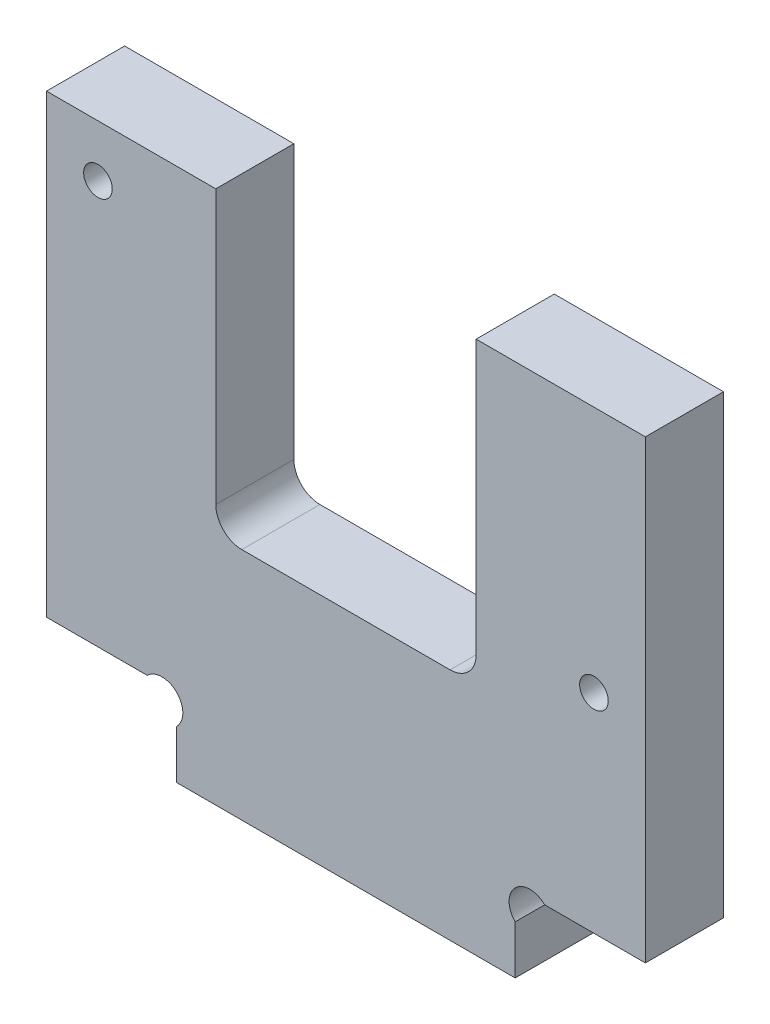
ISO-10303-21;
HEADER;
FILE_DESCRIPTION(('STEP AP214'),'2;1');
FILE_NAME('part.step','',(''),(''),'','','');
FILE_SCHEMA(('AUTOMOTIVE_DESIGN { 1 0 10303 214 1 1 1 1 }'));
ENDSEC;
DATA;
#1=APPLICATION_CONTEXT('core data for automotive mechanical design processes');
#2=APPLICATION_PROTOCOL_DEFINITION('international standard','automotive_design',2000,#1);
#3=PRODUCT_CONTEXT('',#1,'mechanical');
#4=PRODUCT('Part','Part','',(#3));
#5=PRODUCT_RELATED_PRODUCT_CATEGORY('part','',(#4));
#6=PRODUCT_DEFINITION_FORMATION('','',#4);
#7=PRODUCT_DEFINITION_CONTEXT('part definition',#1,'design');
#8=PRODUCT_DEFINITION('design','',#6,#7);
#9=PRODUCT_DEFINITION_SHAPE('','',#8);
#10=(LENGTH_UNIT() NAMED_UNIT(*) SI_UNIT(.MILLI.,.METRE.));
#11=(NAMED_UNIT(*) PLANE_ANGLE_UNIT() SI_UNIT($,.RADIAN.));
#12=(NAMED_UNIT(*) SI_UNIT($,.STERADIAN.) SOLID_ANGLE_UNIT());
#13=UNCERTAINTY_MEASURE_WITH_UNIT(LENGTH_MEASURE(1.E-05),#10,'distance_accuracy_value','');
#14=(GEOMETRIC_REPRESENTATION_CONTEXT(3) GLOBAL_UNCERTAINTY_ASSIGNED_CONTEXT((#13)) GLOBAL_UNIT_ASSIGNED_CONTEXT((#10,
#11,#12)) REPRESENTATION_CONTEXT('',''));
#15=CARTESIAN_POINT('',(0.,0.,0.));
#16=DIRECTION('',(0.,0.,1.));
#17=DIRECTION('',(1.,0.,0.));
#18=AXIS2_PLACEMENT_3D('',#15,#16,#17);
#19=CARTESIAN_POINT('',(37.1313708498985,4.8686291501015,6.));
#20=DIRECTION('',(0.,0.,1.));
#21=DIRECTION('',(1.,0.,0.));
#22=AXIS2_PLACEMENT_3D('',#19,#20,#21);
#23=PLANE('',#22);
#24=CARTESIAN_POINT('',(42.05,22.,6.));
#25=DIRECTION('',(0.,0.,1.));
#26=DIRECTION('',(1.,0.,0.));
#27=AXIS2_PLACEMENT_3D('',#24,#25,#26);
#28=CIRCLE('',#27,1.1);
#29=CARTESIAN_POINT('',(43.15,22.,6.));
#30=VERTEX_POINT('',#29);
#31=EDGE_CURVE('E186',#30,#30,#28,.T.);
#32=ORIENTED_EDGE('',*,*,#31,.F.);
#33=EDGE_LOOP('',(#32));
#34=FACE_BOUND('',#33,.T.);
#35=DIRECTION('',(-1.,0.,0.));
#36=VECTOR('',#35,1.);
#37=CARTESIAN_POINT('',(33.,41.,6.));
#38=LINE('',#37,#36);
#39=CARTESIAN_POINT('',(46.,41.,6.));
#40=VERTEX_POINT('',#39);
#41=CARTESIAN_POINT('',(33.,41.,6.));
#42=VERTEX_POINT('',#41);
#43=EDGE_CURVE('E213',#40,#42,#38,.T.);
#44=ORIENTED_EDGE('',*,*,#43,.T.);
#45=DIRECTION('',(0.,-1.,0.));
#46=VECTOR('',#45,1.);
#47=CARTESIAN_POINT('',(33.,20.,6.));
#48=LINE('',#47,#46);
#49=CARTESIAN_POINT('',(33.,20.,6.));
#50=VERTEX_POINT('',#49);
#51=EDGE_CURVE('E121',#42,#50,#48,.T.);
#52=ORIENTED_EDGE('',*,*,#51,.T.);
#53=CARTESIAN_POINT('',(31.,20.,6.));
#54=DIRECTION('',(0.,0.,-1.));
#55=DIRECTION('',(1.,0.,0.));
#56=AXIS2_PLACEMENT_3D('',#53,#54,#55);
#57=CIRCLE('',#56,2.);
#58=CARTESIAN_POINT('',(31.,18.,6.));
#59=VERTEX_POINT('',#58);
#60=EDGE_CURVE('E252',#50,#59,#57,.T.);
#61=ORIENTED_EDGE('',*,*,#60,.T.);
#62=DIRECTION('',(-1.,0.,0.));
#63=VECTOR('',#62,1.);
#64=CARTESIAN_POINT('',(15.,18.,6.));
#65=LINE('',#64,#63);
#66=CARTESIAN_POINT('',(15.,18.,6.));
#67=VERTEX_POINT('',#66);
#68=EDGE_CURVE('E271',#59,#67,#65,.T.);
#69=ORIENTED_EDGE('',*,*,#68,.T.);
#70=CARTESIAN_POINT('',(15.,20.,6.));
#71=DIRECTION('',(0.,0.,-1.));
#72=DIRECTION('',(1.,0.,0.));
#73=AXIS2_PLACEMENT_3D('',#70,#71,#72);
#74=CIRCLE('',#73,2.);
#75=CARTESIAN_POINT('',(13.,20.,6.));
#76=VERTEX_POINT('',#75);
#77=EDGE_CURVE('E268',#67,#76,#74,.T.);
#78=ORIENTED_EDGE('',*,*,#77,.T.);
#79=DIRECTION('',(0.,1.,0.));
#80=VECTOR('',#79,1.);
#81=CARTESIAN_POINT('',(13.,41.,6.));
#82=LINE('',#81,#80);
#83=CARTESIAN_POINT('',(13.,41.,6.));
#84=VERTEX_POINT('',#83);
#85=EDGE_CURVE('E270',#76,#84,#82,.T.);
#86=ORIENTED_EDGE('',*,*,#85,.T.);
#87=DIRECTION('',(-1.,0.,0.));
#88=VECTOR('',#87,1.);
#89=CARTESIAN_POINT('',(0.,41.,6.));
#90=LINE('',#89,#88);
#91=CARTESIAN_POINT('',(0.,41.,6.));
#92=VERTEX_POINT('',#91);
#93=EDGE_CURVE('E273',#84,#92,#90,.T.);
#94=ORIENTED_EDGE('',*,*,#93,.T.);
#95=DIRECTION('',(0.,-1.,0.));
#96=VECTOR('',#95,1.);
#97=CARTESIAN_POINT('',(0.,5.99999999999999,6.));
#98=LINE('',#97,#96);
#99=CARTESIAN_POINT('',(0.,5.99999999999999,6.));
#100=VERTEX_POINT('',#99);
#101=EDGE_CURVE('E279',#92,#100,#98,.T.);
#102=ORIENTED_EDGE('',*,*,#101,.T.);
#103=DIRECTION('',(1.,0.,0.));
#104=VECTOR('',#103,1.);
#105=CARTESIAN_POINT('',(7.73725830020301,6.,6.));
#106=LINE('',#105,#104);
#107=CARTESIAN_POINT('',(7.73725830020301,6.,6.));
#108=VERTEX_POINT('',#107);
#109=EDGE_CURVE('E281',#100,#108,#106,.T.);
#110=ORIENTED_EDGE('',*,*,#109,.T.);
#111=CARTESIAN_POINT('',(8.8686291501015,4.86862915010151,6.));
#112=DIRECTION('',(0.,0.,-1.));
#113=DIRECTION('',(-1.,0.,0.));
#114=AXIS2_PLACEMENT_3D('',#111,#112,#113);
#115=CIRCLE('',#114,1.60000000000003);
#116=CARTESIAN_POINT('',(10.,3.73725830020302,6.));
#117=VERTEX_POINT('',#116);
#118=EDGE_CURVE('E283',#108,#117,#115,.T.);
#119=ORIENTED_EDGE('',*,*,#118,.T.);
#120=DIRECTION('',(0.,-1.,0.));
#121=VECTOR('',#120,1.);
#122=CARTESIAN_POINT('',(10.,3.73725830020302,6.));
#123=LINE('',#122,#121);
#124=CARTESIAN_POINT('',(10.,0.,6.));
#125=VERTEX_POINT('',#124);
#126=EDGE_CURVE('E285',#117,#125,#123,.T.);
#127=ORIENTED_EDGE('',*,*,#126,.T.);
#128=DIRECTION('',(1.,0.,0.));
#129=VECTOR('',#128,1.);
#130=CARTESIAN_POINT('',(10.,0.,6.));
#131=LINE('',#130,#129);
#132=CARTESIAN_POINT('',(36.,0.,6.));
#133=VERTEX_POINT('',#132);
#134=EDGE_CURVE('E287',#125,#133,#131,.T.);
#135=ORIENTED_EDGE('',*,*,#134,.T.);
#136=DIRECTION('',(0.,1.,0.));
#137=VECTOR('',#136,1.);
#138=CARTESIAN_POINT('',(36.,3.73725830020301,6.));
#139=LINE('',#138,#137);
#140=CARTESIAN_POINT('',(36.,3.73725830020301,6.));
#141=VERTEX_POINT('',#140);
#142=EDGE_CURVE('E164',#133,#141,#139,.T.);
#143=ORIENTED_EDGE('',*,*,#142,.T.);
#144=CARTESIAN_POINT('',(37.1313708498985,4.8686291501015,6.));
#145=DIRECTION('',(0.,0.,-1.));
#146=DIRECTION('',(1.,0.,0.));
#147=AXIS2_PLACEMENT_3D('',#144,#145,#146);
#148=CIRCLE('',#147,1.60000000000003);
#149=CARTESIAN_POINT('',(38.262741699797,6.,6.));
#150=VERTEX_POINT('',#149);
#151=EDGE_CURVE('E158',#141,#150,#148,.T.);
#152=ORIENTED_EDGE('',*,*,#151,.T.);
#153=DIRECTION('',(1.,0.,0.));
#154=VECTOR('',#153,1.);
#155=CARTESIAN_POINT('',(38.262741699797,6.,6.));
#156=LINE('',#155,#154);
#157=CARTESIAN_POINT('',(46.,6.,6.));
#158=VERTEX_POINT('',#157);
#159=EDGE_CURVE('E162',#150,#158,#156,.T.);
#160=ORIENTED_EDGE('',*,*,#159,.T.);
#161=DIRECTION('',(0.,1.,0.));
#162=VECTOR('',#161,1.);
#163=CARTESIAN_POINT('',(46.,6.,6.));
#164=LINE('',#163,#162);
#165=EDGE_CURVE('E54',#158,#40,#164,.T.);
#166=ORIENTED_EDGE('',*,*,#165,.T.);
#167=EDGE_LOOP('',(#44,#52,#61,#69,#78,#86,#94,#102,#110,#119,#127,#135,#143,#152,#160,#166));
#168=FACE_BOUND('',#167,.T.);
#169=CARTESIAN_POINT('',(3.95000000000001,37.,6.));
#170=DIRECTION('',(0.,0.,1.));
#171=DIRECTION('',(1.,0.,0.));
#172=AXIS2_PLACEMENT_3D('',#169,#170,#171);
#173=CIRCLE('',#172,1.1);
#174=CARTESIAN_POINT('',(5.05000000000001,37.,6.));
#175=VERTEX_POINT('',#174);
#176=EDGE_CURVE('E330',#175,#175,#173,.T.);
#177=ORIENTED_EDGE('',*,*,#176,.F.);
#178=EDGE_LOOP('',(#177));
#179=FACE_BOUND('',#178,.T.);
#180=ADVANCED_FACE('F37',(#34,#168,#179),#23,.T.);
#181=CARTESIAN_POINT('',(37.1313708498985,4.8686291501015,0.));
#182=DIRECTION('',(0.,0.,1.));
#183=DIRECTION('',(1.,0.,0.));
#184=AXIS2_PLACEMENT_3D('',#181,#182,#183);
#185=PLANE('',#184);
#186=CARTESIAN_POINT('',(42.05,22.,0.));
#187=DIRECTION('',(0.,0.,1.));
#188=DIRECTION('',(1.,0.,0.));
#189=AXIS2_PLACEMENT_3D('',#186,#187,#188);
#190=CIRCLE('',#189,1.1);
#191=CARTESIAN_POINT('',(43.15,22.,0.));
#192=VERTEX_POINT('',#191);
#193=EDGE_CURVE('E335',#192,#192,#190,.T.);
#194=ORIENTED_EDGE('',*,*,#193,.T.);
#195=EDGE_LOOP('',(#194));
#196=FACE_BOUND('',#195,.T.);
#197=DIRECTION('',(-1.,0.,0.));
#198=VECTOR('',#197,1.);
#199=CARTESIAN_POINT('',(33.,41.,0.));
#200=LINE('',#199,#198);
#201=CARTESIAN_POINT('',(46.,41.,0.));
#202=VERTEX_POINT('',#201);
#203=CARTESIAN_POINT('',(33.,41.,0.));
#204=VERTEX_POINT('',#203);
#205=EDGE_CURVE('E182',#202,#204,#200,.T.);
#206=ORIENTED_EDGE('',*,*,#205,.F.);
#207=DIRECTION('',(0.,1.,0.));
#208=VECTOR('',#207,1.);
#209=CARTESIAN_POINT('',(46.,6.,0.));
#210=LINE('',#209,#208);
#211=CARTESIAN_POINT('',(46.,6.,0.));
#212=VERTEX_POINT('',#211);
#213=EDGE_CURVE('E113',#212,#202,#210,.T.);
#214=ORIENTED_EDGE('',*,*,#213,.F.);
#215=DIRECTION('',(1.,0.,0.));
#216=VECTOR('',#215,1.);
#217=CARTESIAN_POINT('',(38.262741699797,6.,0.));
#218=LINE('',#217,#216);
#219=CARTESIAN_POINT('',(38.262741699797,6.,0.));
#220=VERTEX_POINT('',#219);
#221=EDGE_CURVE('E107',#220,#212,#218,.T.);
#222=ORIENTED_EDGE('',*,*,#221,.F.);
#223=CARTESIAN_POINT('',(37.1313708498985,4.8686291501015,0.));
#224=DIRECTION('',(0.,0.,-1.));
#225=DIRECTION('',(1.,0.,0.));
#226=AXIS2_PLACEMENT_3D('',#223,#224,#225);
#227=CIRCLE('',#226,1.60000000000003);
#228=CARTESIAN_POINT('',(36.,3.73725830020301,0.));
#229=VERTEX_POINT('',#228);
#230=EDGE_CURVE('E172',#229,#220,#227,.T.);
#231=ORIENTED_EDGE('',*,*,#230,.F.);
#232=DIRECTION('',(0.,1.,0.));
#233=VECTOR('',#232,1.);
#234=CARTESIAN_POINT('',(36.,3.73725830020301,0.));
#235=LINE('',#234,#233);
#236=CARTESIAN_POINT('',(36.,0.,0.));
#237=VERTEX_POINT('',#236);
#238=EDGE_CURVE('E208',#237,#229,#235,.T.);
#239=ORIENTED_EDGE('',*,*,#238,.F.);
#240=DIRECTION('',(1.,0.,0.));
#241=VECTOR('',#240,1.);
#242=CARTESIAN_POINT('',(10.,0.,0.));
#243=LINE('',#242,#241);
#244=CARTESIAN_POINT('',(10.,0.,0.));
#245=VERTEX_POINT('',#244);
#246=EDGE_CURVE('E206',#245,#237,#243,.T.);
#247=ORIENTED_EDGE('',*,*,#246,.F.);
#248=DIRECTION('',(0.,-1.,0.));
#249=VECTOR('',#248,1.);
#250=CARTESIAN_POINT('',(10.,3.73725830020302,0.));
#251=LINE('',#250,#249);
#252=CARTESIAN_POINT('',(10.,3.73725830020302,0.));
#253=VERTEX_POINT('',#252);
#254=EDGE_CURVE('E204',#253,#245,#251,.T.);
#255=ORIENTED_EDGE('',*,*,#254,.F.);
#256=CARTESIAN_POINT('',(8.8686291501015,4.86862915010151,0.));
#257=DIRECTION('',(0.,0.,-1.));
#258=DIRECTION('',(-1.,0.,0.));
#259=AXIS2_PLACEMENT_3D('',#256,#257,#258);
#260=CIRCLE('',#259,1.60000000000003);
#261=CARTESIAN_POINT('',(7.73725830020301,6.,0.));
#262=VERTEX_POINT('',#261);
#263=EDGE_CURVE('E202',#262,#253,#260,.T.);
#264=ORIENTED_EDGE('',*,*,#263,.F.);
#265=DIRECTION('',(1.,0.,0.));
#266=VECTOR('',#265,1.);
#267=CARTESIAN_POINT('',(7.73725830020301,6.,0.));
#268=LINE('',#267,#266);
#269=CARTESIAN_POINT('',(0.,5.99999999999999,0.));
#270=VERTEX_POINT('',#269);
#271=EDGE_CURVE('E200',#270,#262,#268,.T.);
#272=ORIENTED_EDGE('',*,*,#271,.F.);
#273=DIRECTION('',(0.,-1.,0.));
#274=VECTOR('',#273,1.);
#275=CARTESIAN_POINT('',(0.,5.99999999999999,0.));
#276=LINE('',#275,#274);
#277=CARTESIAN_POINT('',(0.,41.,0.));
#278=VERTEX_POINT('',#277);
#279=EDGE_CURVE('E198',#278,#270,#276,.T.);
#280=ORIENTED_EDGE('',*,*,#279,.F.);
#281=DIRECTION('',(-1.,0.,0.));
#282=VECTOR('',#281,1.);
#283=CARTESIAN_POINT('',(0.,41.,0.));
#284=LINE('',#283,#282);
#285=CARTESIAN_POINT('',(13.,41.,0.));
#286=VERTEX_POINT('',#285);
#287=EDGE_CURVE('E196',#286,#278,#284,.T.);
#288=ORIENTED_EDGE('',*,*,#287,.F.);
#289=DIRECTION('',(0.,1.,0.));
#290=VECTOR('',#289,1.);
#291=CARTESIAN_POINT('',(13.,41.,0.));
#292=LINE('',#291,#290);
#293=CARTESIAN_POINT('',(13.,20.,0.));
#294=VERTEX_POINT('',#293);
#295=EDGE_CURVE('E194',#294,#286,#292,.T.);
#296=ORIENTED_EDGE('',*,*,#295,.F.);
#297=CARTESIAN_POINT('',(15.,20.,0.));
#298=DIRECTION('',(0.,0.,-1.));
#299=DIRECTION('',(1.,0.,0.));
#300=AXIS2_PLACEMENT_3D('',#297,#298,#299);
#301=CIRCLE('',#300,2.);
#302=CARTESIAN_POINT('',(15.,18.,0.));
#303=VERTEX_POINT('',#302);
#304=EDGE_CURVE('E192',#303,#294,#301,.T.);
#305=ORIENTED_EDGE('',*,*,#304,.F.);
#306=DIRECTION('',(-1.,0.,0.));
#307=VECTOR('',#306,1.);
#308=CARTESIAN_POINT('',(15.,18.,0.));
#309=LINE('',#308,#307);
#310=CARTESIAN_POINT('',(31.,18.,0.));
#311=VERTEX_POINT('',#310);
#312=EDGE_CURVE('E190',#311,#303,#309,.T.);
#313=ORIENTED_EDGE('',*,*,#312,.F.);
#314=CARTESIAN_POINT('',(31.,20.,0.));
#315=DIRECTION('',(0.,0.,-1.));
#316=DIRECTION('',(1.,0.,0.));
#317=AXIS2_PLACEMENT_3D('',#314,#315,#316);
#318=CIRCLE('',#317,2.);
#319=CARTESIAN_POINT('',(33.,20.,0.));
#320=VERTEX_POINT('',#319);
#321=EDGE_CURVE('E188',#320,#311,#318,.T.);
#322=ORIENTED_EDGE('',*,*,#321,.F.);
#323=DIRECTION('',(0.,-1.,0.));
#324=VECTOR('',#323,1.);
#325=CARTESIAN_POINT('',(33.,20.,0.));
#326=LINE('',#325,#324);
#327=EDGE_CURVE('E185',#204,#320,#326,.T.);
#328=ORIENTED_EDGE('',*,*,#327,.F.);
#329=EDGE_LOOP('',(#206,#214,#222,#231,#239,#247,#255,#264,#272,#280,#288,#296,#305,#313,#322,#328));
#330=FACE_BOUND('',#329,.T.);
#331=CARTESIAN_POINT('',(3.95000000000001,37.,0.));
#332=DIRECTION('',(0.,0.,1.));
#333=DIRECTION('',(1.,0.,0.));
#334=AXIS2_PLACEMENT_3D('',#331,#332,#333);
#335=CIRCLE('',#334,1.1);
#336=CARTESIAN_POINT('',(5.05000000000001,37.,0.));
#337=VERTEX_POINT('',#336);
#338=EDGE_CURVE('E333',#337,#337,#335,.T.);
#339=ORIENTED_EDGE('',*,*,#338,.T.);
#340=EDGE_LOOP('',(#339));
#341=FACE_BOUND('',#340,.T.);
#342=ADVANCED_FACE('F256',(#196,#330,#341),#185,.F.);
#343=CARTESIAN_POINT('',(33.,41.,6.));
#344=DIRECTION('',(0.,-1.,0.));
#345=DIRECTION('',(0.,0.,-1.));
#346=AXIS2_PLACEMENT_3D('',#343,#344,#345);
#347=PLANE('',#346);
#348=ORIENTED_EDGE('',*,*,#205,.T.);
#349=DIRECTION('',(0.,0.,-1.));
#350=VECTOR('',#349,1.);
#351=CARTESIAN_POINT('',(33.,41.,6.));
#352=LINE('',#351,#350);
#353=EDGE_CURVE('E11',#42,#204,#352,.T.);
#354=ORIENTED_EDGE('',*,*,#353,.F.);
#355=ORIENTED_EDGE('',*,*,#43,.F.);
#356=DIRECTION('',(0.,0.,-1.));
#357=VECTOR('',#356,1.);
#358=CARTESIAN_POINT('',(46.,41.,6.));
#359=LINE('',#358,#357);
#360=EDGE_CURVE('E178',#40,#202,#359,.T.);
#361=ORIENTED_EDGE('',*,*,#360,.T.);
#362=EDGE_LOOP('',(#348,#354,#355,#361));
#363=FACE_BOUND('',#362,.T.);
#364=ADVANCED_FACE('F39',(#363),#347,.F.);
#365=CARTESIAN_POINT('',(33.,20.,6.));
#366=DIRECTION('',(1.,0.,0.));
#367=DIRECTION('',(0.,1.,0.));
#368=AXIS2_PLACEMENT_3D('',#365,#366,#367);
#369=PLANE('',#368);
#370=ORIENTED_EDGE('',*,*,#327,.T.);
#371=DIRECTION('',(0.,0.,-1.));
#372=VECTOR('',#371,1.);
#373=CARTESIAN_POINT('',(33.,20.,6.));
#374=LINE('',#373,#372);
#375=EDGE_CURVE('E46',#50,#320,#374,.T.);
#376=ORIENTED_EDGE('',*,*,#375,.F.);
#377=ORIENTED_EDGE('',*,*,#51,.F.);
#378=ORIENTED_EDGE('',*,*,#353,.T.);
#379=EDGE_LOOP('',(#370,#376,#377,#378));
#380=FACE_BOUND('',#379,.T.);
#381=ADVANCED_FACE('F468',(#380),#369,.F.);
#382=CARTESIAN_POINT('',(31.,20.,6.));
#383=DIRECTION('',(0.,0.,-1.));
#384=DIRECTION('',(-1.,0.,0.));
#385=AXIS2_PLACEMENT_3D('',#382,#383,#384);
#386=CYLINDRICAL_SURFACE('',#385,2.);
#387=ORIENTED_EDGE('',*,*,#321,.T.);
#388=DIRECTION('',(0.,0.,-1.));
#389=VECTOR('',#388,1.);
#390=CARTESIAN_POINT('',(31.,18.,6.));
#391=LINE('',#390,#389);
#392=EDGE_CURVE('E244',#59,#311,#391,.T.);
#393=ORIENTED_EDGE('',*,*,#392,.F.);
#394=ORIENTED_EDGE('',*,*,#60,.F.);
#395=ORIENTED_EDGE('',*,*,#375,.T.);
#396=EDGE_LOOP('',(#387,#393,#394,#395));
#397=FACE_BOUND('',#396,.T.);
#398=ADVANCED_FACE('F250',(#397),#386,.F.);
#399=CARTESIAN_POINT('',(15.,18.,6.));
#400=DIRECTION('',(0.,-1.,0.));
#401=DIRECTION('',(0.,0.,-1.));
#402=AXIS2_PLACEMENT_3D('',#399,#400,#401);
#403=PLANE('',#402);
#404=ORIENTED_EDGE('',*,*,#312,.T.);
#405=DIRECTION('',(0.,0.,-1.));
#406=VECTOR('',#405,1.);
#407=CARTESIAN_POINT('',(15.,18.,6.));
#408=LINE('',#407,#406);
#409=EDGE_CURVE('E241',#67,#303,#408,.T.);
#410=ORIENTED_EDGE('',*,*,#409,.F.);
#411=ORIENTED_EDGE('',*,*,#68,.F.);
#412=ORIENTED_EDGE('',*,*,#392,.T.);
#413=EDGE_LOOP('',(#404,#410,#411,#412));
#414=FACE_BOUND('',#413,.T.);
#415=ADVANCED_FACE('F262',(#414),#403,.F.);
#416=CARTESIAN_POINT('',(15.,20.,6.));
#417=DIRECTION('',(0.,0.,-1.));
#418=DIRECTION('',(-1.,0.,0.));
#419=AXIS2_PLACEMENT_3D('',#416,#417,#418);
#420=CYLINDRICAL_SURFACE('',#419,2.);
#421=ORIENTED_EDGE('',*,*,#304,.T.);
#422=DIRECTION('',(0.,0.,-1.));
#423=VECTOR('',#422,1.);
#424=CARTESIAN_POINT('',(13.,20.,6.));
#425=LINE('',#424,#423);
#426=EDGE_CURVE('E238',#76,#294,#425,.T.);
#427=ORIENTED_EDGE('',*,*,#426,.F.);
#428=ORIENTED_EDGE('',*,*,#77,.F.);
#429=ORIENTED_EDGE('',*,*,#409,.T.);
#430=EDGE_LOOP('',(#421,#427,#428,#429));
#431=FACE_BOUND('',#430,.T.);
#432=ADVANCED_FACE('F266',(#431),#420,.F.);
#433=CARTESIAN_POINT('',(13.,41.,6.));
#434=DIRECTION('',(-1.,0.,0.));
#435=DIRECTION('',(0.,0.,1.));
#436=AXIS2_PLACEMENT_3D('',#433,#434,#435);
#437=PLANE('',#436);
#438=ORIENTED_EDGE('',*,*,#295,.T.);
#439=DIRECTION('',(0.,0.,-1.));
#440=VECTOR('',#439,1.);
#441=CARTESIAN_POINT('',(13.,41.,6.));
#442=LINE('',#441,#440);
#443=EDGE_CURVE('E235',#84,#286,#442,.T.);
#444=ORIENTED_EDGE('',*,*,#443,.F.);
#445=ORIENTED_EDGE('',*,*,#85,.F.);
#446=ORIENTED_EDGE('',*,*,#426,.T.);
#447=EDGE_LOOP('',(#438,#444,#445,#446));
#448=FACE_BOUND('',#447,.T.);
#449=ADVANCED_FACE('F433',(#448),#437,.F.);
#450=CARTESIAN_POINT('',(0.,41.,6.));
#451=DIRECTION('',(0.,-1.,0.));
#452=DIRECTION('',(0.,0.,-1.));
#453=AXIS2_PLACEMENT_3D('',#450,#451,#452);
#454=PLANE('',#453);
#455=ORIENTED_EDGE('',*,*,#287,.T.);
#456=DIRECTION('',(0.,0.,-1.));
#457=VECTOR('',#456,1.);
#458=CARTESIAN_POINT('',(0.,41.,6.));
#459=LINE('',#458,#457);
#460=EDGE_CURVE('E232',#92,#278,#459,.T.);
#461=ORIENTED_EDGE('',*,*,#460,.F.);
#462=ORIENTED_EDGE('',*,*,#93,.F.);
#463=ORIENTED_EDGE('',*,*,#443,.T.);
#464=EDGE_LOOP('',(#455,#461,#462,#463));
#465=FACE_BOUND('',#464,.T.);
#466=ADVANCED_FACE('F423',(#465),#454,.F.);
#467=CARTESIAN_POINT('',(0.,5.99999999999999,6.));
#468=DIRECTION('',(1.,0.,0.));
#469=DIRECTION('',(0.,0.,-1.));
#470=AXIS2_PLACEMENT_3D('',#467,#468,#469);
#471=PLANE('',#470);
#472=ORIENTED_EDGE('',*,*,#279,.T.);
#473=DIRECTION('',(0.,0.,-1.));
#474=VECTOR('',#473,1.);
#475=CARTESIAN_POINT('',(0.,5.99999999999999,6.));
#476=LINE('',#475,#474);
#477=EDGE_CURVE('E229',#100,#270,#476,.T.);
#478=ORIENTED_EDGE('',*,*,#477,.F.);
#479=ORIENTED_EDGE('',*,*,#101,.F.);
#480=ORIENTED_EDGE('',*,*,#460,.T.);
#481=EDGE_LOOP('',(#472,#478,#479,#480));
#482=FACE_BOUND('',#481,.T.);
#483=ADVANCED_FACE('F413',(#482),#471,.F.);
#484=CARTESIAN_POINT('',(7.73725830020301,6.,6.));
#485=DIRECTION('',(0.,1.,0.));
#486=DIRECTION('',(-1.,0.,0.));
#487=AXIS2_PLACEMENT_3D('',#484,#485,#486);
#488=PLANE('',#487);
#489=ORIENTED_EDGE('',*,*,#271,.T.);
#490=DIRECTION('',(0.,0.,-1.));
#491=VECTOR('',#490,1.);
#492=CARTESIAN_POINT('',(7.73725830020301,6.,6.));
#493=LINE('',#492,#491);
#494=EDGE_CURVE('E226',#108,#262,#493,.T.);
#495=ORIENTED_EDGE('',*,*,#494,.F.);
#496=ORIENTED_EDGE('',*,*,#109,.F.);
#497=ORIENTED_EDGE('',*,*,#477,.T.);
#498=EDGE_LOOP('',(#489,#495,#496,#497));
#499=FACE_BOUND('',#498,.T.);
#500=ADVANCED_FACE('F403',(#499),#488,.F.);
#501=CARTESIAN_POINT('',(8.8686291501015,4.86862915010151,6.));
#502=DIRECTION('',(0.,0.,-1.));
#503=DIRECTION('',(-1.,0.,0.));
#504=AXIS2_PLACEMENT_3D('',#501,#502,#503);
#505=CYLINDRICAL_SURFACE('',#504,1.60000000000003);
#506=ORIENTED_EDGE('',*,*,#263,.T.);
#507=DIRECTION('',(0.,0.,-1.));
#508=VECTOR('',#507,1.);
#509=CARTESIAN_POINT('',(10.,3.73725830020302,6.));
#510=LINE('',#509,#508);
#511=EDGE_CURVE('E223',#117,#253,#510,.T.);
#512=ORIENTED_EDGE('',*,*,#511,.F.);
#513=ORIENTED_EDGE('',*,*,#118,.F.);
#514=ORIENTED_EDGE('',*,*,#494,.T.);
#515=EDGE_LOOP('',(#506,#512,#513,#514));
#516=FACE_BOUND('',#515,.T.);
#517=ADVANCED_FACE('F393',(#516),#505,.F.);
#518=CARTESIAN_POINT('',(10.,3.73725830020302,6.));
#519=DIRECTION('',(1.,0.,0.));
#520=DIRECTION('',(0.,0.,-1.));
#521=AXIS2_PLACEMENT_3D('',#518,#519,#520);
#522=PLANE('',#521);
#523=ORIENTED_EDGE('',*,*,#254,.T.);
#524=DIRECTION('',(0.,0.,-1.));
#525=VECTOR('',#524,1.);
#526=CARTESIAN_POINT('',(10.,0.,6.));
#527=LINE('',#526,#525);
#528=EDGE_CURVE('E220',#125,#245,#527,.T.);
#529=ORIENTED_EDGE('',*,*,#528,.F.);
#530=ORIENTED_EDGE('',*,*,#126,.F.);
#531=ORIENTED_EDGE('',*,*,#511,.T.);
#532=EDGE_LOOP('',(#523,#529,#530,#531));
#533=FACE_BOUND('',#532,.T.);
#534=ADVANCED_FACE('F384',(#533),#522,.F.);
#535=CARTESIAN_POINT('',(10.,0.,6.));
#536=DIRECTION('',(0.,1.,0.));
#537=DIRECTION('',(0.,0.,1.));
#538=AXIS2_PLACEMENT_3D('',#535,#536,#537);
#539=PLANE('',#538);
#540=ORIENTED_EDGE('',*,*,#246,.T.);
#541=DIRECTION('',(0.,0.,-1.));
#542=VECTOR('',#541,1.);
#543=CARTESIAN_POINT('',(36.,0.,6.));
#544=LINE('',#543,#542);
#545=EDGE_CURVE('E217',#133,#237,#544,.T.);
#546=ORIENTED_EDGE('',*,*,#545,.F.);
#547=ORIENTED_EDGE('',*,*,#134,.F.);
#548=ORIENTED_EDGE('',*,*,#528,.T.);
#549=EDGE_LOOP('',(#540,#546,#547,#548));
#550=FACE_BOUND('',#549,.T.);
#551=ADVANCED_FACE('F293',(#550),#539,.F.);
#552=CARTESIAN_POINT('',(36.,3.73725830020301,6.));
#553=DIRECTION('',(-1.,0.,0.));
#554=DIRECTION('',(0.,0.,1.));
#555=AXIS2_PLACEMENT_3D('',#552,#553,#554);
#556=PLANE('',#555);
#557=ORIENTED_EDGE('',*,*,#238,.T.);
#558=DIRECTION('',(0.,0.,-1.));
#559=VECTOR('',#558,1.);
#560=CARTESIAN_POINT('',(36.,3.73725830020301,6.));
#561=LINE('',#560,#559);
#562=EDGE_CURVE('E173',#141,#229,#561,.T.);
#563=ORIENTED_EDGE('',*,*,#562,.F.);
#564=ORIENTED_EDGE('',*,*,#142,.F.);
#565=ORIENTED_EDGE('',*,*,#545,.T.);
#566=EDGE_LOOP('',(#557,#563,#564,#565));
#567=FACE_BOUND('',#566,.T.);
#568=ADVANCED_FACE('F297',(#567),#556,.F.);
#569=CARTESIAN_POINT('',(37.1313708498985,4.8686291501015,6.));
#570=DIRECTION('',(0.,0.,-1.));
#571=DIRECTION('',(-1.,0.,0.));
#572=AXIS2_PLACEMENT_3D('',#569,#570,#571);
#573=CYLINDRICAL_SURFACE('',#572,1.60000000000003);
#574=ORIENTED_EDGE('',*,*,#230,.T.);
#575=DIRECTION('',(0.,0.,-1.));
#576=VECTOR('',#575,1.);
#577=CARTESIAN_POINT('',(38.262741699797,6.,6.));
#578=LINE('',#577,#576);
#579=EDGE_CURVE('E169',#150,#220,#578,.T.);
#580=ORIENTED_EDGE('',*,*,#579,.F.);
#581=ORIENTED_EDGE('',*,*,#151,.F.);
#582=ORIENTED_EDGE('',*,*,#562,.T.);
#583=EDGE_LOOP('',(#574,#580,#581,#582));
#584=FACE_BOUND('',#583,.T.);
#585=ADVANCED_FACE('F170',(#584),#573,.F.);
#586=CARTESIAN_POINT('',(38.262741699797,6.,6.));
#587=DIRECTION('',(0.,1.,0.));
#588=DIRECTION('',(-1.,0.,0.));
#589=AXIS2_PLACEMENT_3D('',#586,#587,#588);
#590=PLANE('',#589);
#591=ORIENTED_EDGE('',*,*,#221,.T.);
#592=DIRECTION('',(0.,0.,-1.));
#593=VECTOR('',#592,1.);
#594=CARTESIAN_POINT('',(46.,6.,6.));
#595=LINE('',#594,#593);
#596=EDGE_CURVE('E174',#158,#212,#595,.T.);
#597=ORIENTED_EDGE('',*,*,#596,.F.);
#598=ORIENTED_EDGE('',*,*,#159,.F.);
#599=ORIENTED_EDGE('',*,*,#579,.T.);
#600=EDGE_LOOP('',(#591,#597,#598,#599));
#601=FACE_BOUND('',#600,.T.);
#602=ADVANCED_FACE('F176',(#601),#590,.F.);
#603=CARTESIAN_POINT('',(46.,6.,6.));
#604=DIRECTION('',(-1.,0.,0.));
#605=DIRECTION('',(0.,0.,1.));
#606=AXIS2_PLACEMENT_3D('',#603,#604,#605);
#607=PLANE('',#606);
#608=ORIENTED_EDGE('',*,*,#213,.T.);
#609=ORIENTED_EDGE('',*,*,#360,.F.);
#610=ORIENTED_EDGE('',*,*,#165,.F.);
#611=ORIENTED_EDGE('',*,*,#596,.T.);
#612=EDGE_LOOP('',(#608,#609,#610,#611));
#613=FACE_BOUND('',#612,.T.);
#614=ADVANCED_FACE('F301',(#613),#607,.F.);
#615=CARTESIAN_POINT('',(42.05,22.,6.));
#616=DIRECTION('',(0.,0.,-1.));
#617=DIRECTION('',(-1.,0.,0.));
#618=AXIS2_PLACEMENT_3D('',#615,#616,#617);
#619=CYLINDRICAL_SURFACE('',#618,1.1);
#620=ORIENTED_EDGE('',*,*,#31,.T.);
#621=EDGE_LOOP('',(#620));
#622=FACE_BOUND('',#621,.T.);
#623=ORIENTED_EDGE('',*,*,#193,.F.);
#624=EDGE_LOOP('',(#623));
#625=FACE_BOUND('',#624,.T.);
#626=ADVANCED_FACE('F303',(#622,#625),#619,.F.);
#627=CARTESIAN_POINT('',(3.95000000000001,37.,6.));
#628=DIRECTION('',(0.,0.,-1.));
#629=DIRECTION('',(-1.,0.,0.));
#630=AXIS2_PLACEMENT_3D('',#627,#628,#629);
#631=CYLINDRICAL_SURFACE('',#630,1.1);
#632=ORIENTED_EDGE('',*,*,#176,.T.);
#633=EDGE_LOOP('',(#632));
#634=FACE_BOUND('',#633,.T.);
#635=ORIENTED_EDGE('',*,*,#338,.F.);
#636=EDGE_LOOP('',(#635));
#637=FACE_BOUND('',#636,.T.);
#638=ADVANCED_FACE('F309',(#634,#637),#631,.F.);
#639=CLOSED_SHELL('',(#180,#342,#364,#381,#398,#415,#432,#449,#466,#483,#500,#517,#534,#551,
#568,#585,#602,#614,#626,#638));
#640=MANIFOLD_SOLID_BREP('B2',#639);
#641=ADVANCED_BREP_SHAPE_REPRESENTATION('',(#18,#640),#14);
#642=SHAPE_DEFINITION_REPRESENTATION(#9,#641);
ENDSEC;
END-ISO-10303-21;
